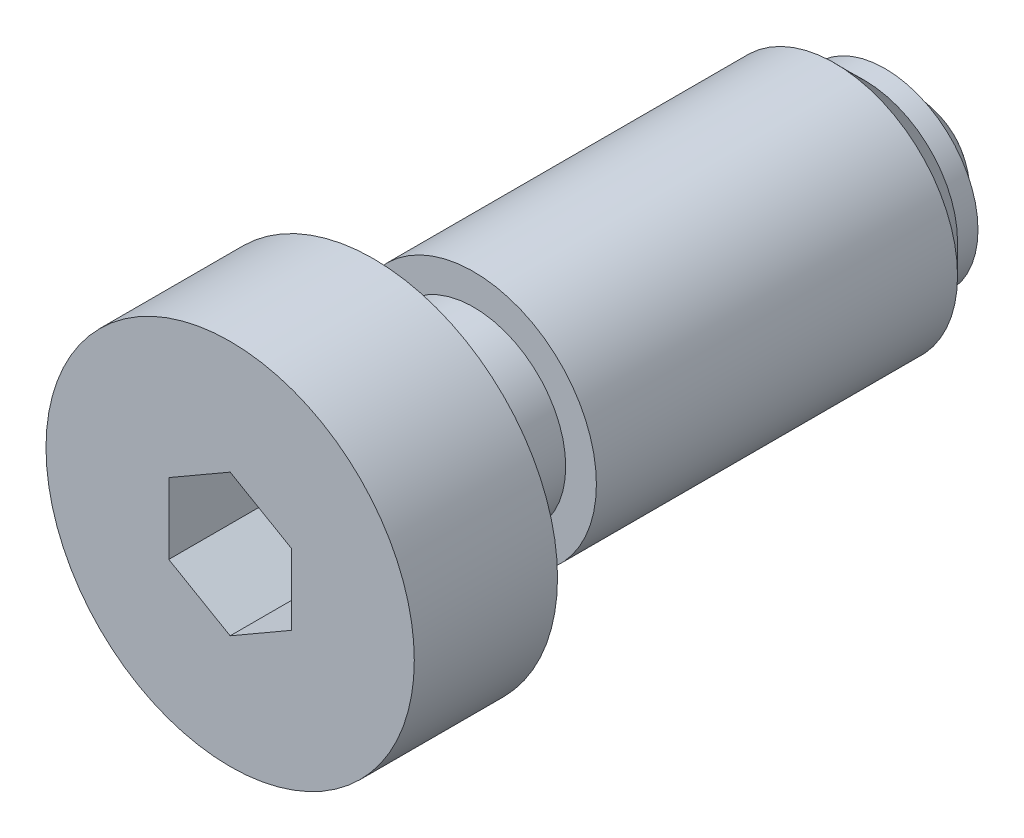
ISO-10303-21;
HEADER;
FILE_DESCRIPTION(('STEP AP214'),'2;1');
FILE_NAME('part.step','',(''),(''),'','','');
FILE_SCHEMA(('AUTOMOTIVE_DESIGN { 1 0 10303 214 1 1 1 1 }'));
ENDSEC;
DATA;
#1=APPLICATION_CONTEXT('core data for automotive mechanical design processes');
#2=APPLICATION_PROTOCOL_DEFINITION('international standard','automotive_design',2000,#1);
#3=PRODUCT_CONTEXT('',#1,'mechanical');
#4=PRODUCT('Part','Part','',(#3));
#5=PRODUCT_RELATED_PRODUCT_CATEGORY('part','',(#4));
#6=PRODUCT_DEFINITION_FORMATION('','',#4);
#7=PRODUCT_DEFINITION_CONTEXT('part definition',#1,'design');
#8=PRODUCT_DEFINITION('design','',#6,#7);
#9=PRODUCT_DEFINITION_SHAPE('','',#8);
#10=(LENGTH_UNIT() NAMED_UNIT(*) SI_UNIT(.MILLI.,.METRE.));
#11=(NAMED_UNIT(*) PLANE_ANGLE_UNIT() SI_UNIT($,.RADIAN.));
#12=(NAMED_UNIT(*) SI_UNIT($,.STERADIAN.) SOLID_ANGLE_UNIT());
#13=UNCERTAINTY_MEASURE_WITH_UNIT(LENGTH_MEASURE(1.E-05),#10,'distance_accuracy_value','');
#14=(GEOMETRIC_REPRESENTATION_CONTEXT(3) GLOBAL_UNCERTAINTY_ASSIGNED_CONTEXT((#13)) GLOBAL_UNIT_ASSIGNED_CONTEXT((#10,
#11,#12)) REPRESENTATION_CONTEXT('',''));
#15=CARTESIAN_POINT('',(0.,0.,0.));
#16=DIRECTION('',(0.,0.,1.));
#17=DIRECTION('',(1.,0.,0.));
#18=AXIS2_PLACEMENT_3D('',#15,#16,#17);
#19=CARTESIAN_POINT('',(0.,0.,29.5318271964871));
#20=DIRECTION('',(0.,0.,1.));
#21=DIRECTION('',(1.,0.,0.));
#22=AXIS2_PLACEMENT_3D('',#19,#20,#21);
#23=CYLINDRICAL_SURFACE('',#22,9.);
#24=CARTESIAN_POINT('',(0.,0.,27.5));
#25=DIRECTION('',(0.,0.,1.));
#26=DIRECTION('',(1.,0.,0.));
#27=AXIS2_PLACEMENT_3D('',#24,#25,#26);
#28=CIRCLE('',#27,9.);
#29=CARTESIAN_POINT('',(9.,0.,27.5));
#30=VERTEX_POINT('',#29);
#31=EDGE_CURVE('E9',#30,#30,#28,.T.);
#32=ORIENTED_EDGE('',*,*,#31,.T.);
#33=EDGE_LOOP('',(#32));
#34=FACE_BOUND('',#33,.T.);
#35=CARTESIAN_POINT('',(0.,0.,34.5));
#36=DIRECTION('',(0.,0.,1.));
#37=DIRECTION('',(1.,0.,0.));
#38=AXIS2_PLACEMENT_3D('',#35,#36,#37);
#39=CIRCLE('',#38,9.);
#40=CARTESIAN_POINT('',(9.,0.,34.5));
#41=VERTEX_POINT('',#40);
#42=EDGE_CURVE('E116',#41,#41,#39,.T.);
#43=ORIENTED_EDGE('',*,*,#42,.F.);
#44=EDGE_LOOP('',(#43));
#45=FACE_BOUND('',#44,.T.);
#46=ADVANCED_FACE('F14',(#34,#45),#23,.T.);
#47=CARTESIAN_POINT('',(4.5,0.,27.5));
#48=DIRECTION('',(0.,0.,-1.));
#49=DIRECTION('',(-1.,0.,0.));
#50=AXIS2_PLACEMENT_3D('',#47,#48,#49);
#51=PLANE('',#50);
#52=CARTESIAN_POINT('',(0.,0.,27.5));
#53=DIRECTION('',(0.,0.,1.));
#54=DIRECTION('',(1.,0.,0.));
#55=AXIS2_PLACEMENT_3D('',#52,#53,#54);
#56=CIRCLE('',#55,4.5);
#57=CARTESIAN_POINT('',(4.5,0.,27.5));
#58=VERTEX_POINT('',#57);
#59=EDGE_CURVE('E21',#58,#58,#56,.T.);
#60=ORIENTED_EDGE('',*,*,#59,.T.);
#61=EDGE_LOOP('',(#60));
#62=FACE_BOUND('',#61,.T.);
#63=ORIENTED_EDGE('',*,*,#31,.F.);
#64=EDGE_LOOP('',(#63));
#65=FACE_BOUND('',#64,.T.);
#66=ADVANCED_FACE('F145',(#62,#65),#51,.T.);
#67=CARTESIAN_POINT('',(0.,0.,29.5318271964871));
#68=DIRECTION('',(0.,0.,1.));
#69=DIRECTION('',(1.,0.,0.));
#70=AXIS2_PLACEMENT_3D('',#67,#68,#69);
#71=CYLINDRICAL_SURFACE('',#70,4.5);
#72=CARTESIAN_POINT('',(0.,0.,22.6));
#73=DIRECTION('',(0.,0.,1.));
#74=DIRECTION('',(1.,0.,0.));
#75=AXIS2_PLACEMENT_3D('',#72,#73,#74);
#76=CIRCLE('',#75,4.5);
#77=CARTESIAN_POINT('',(4.5,0.,22.6));
#78=VERTEX_POINT('',#77);
#79=EDGE_CURVE('E140',#78,#78,#76,.T.);
#80=ORIENTED_EDGE('',*,*,#79,.T.);
#81=EDGE_LOOP('',(#80));
#82=FACE_BOUND('',#81,.T.);
#83=ORIENTED_EDGE('',*,*,#59,.F.);
#84=EDGE_LOOP('',(#83));
#85=FACE_BOUND('',#84,.T.);
#86=ADVANCED_FACE('F148',(#82,#85),#71,.T.);
#87=CARTESIAN_POINT('',(4.5,0.,22.6));
#88=DIRECTION('',(0.,0.,1.));
#89=DIRECTION('',(1.,0.,0.));
#90=AXIS2_PLACEMENT_3D('',#87,#88,#89);
#91=PLANE('',#90);
#92=CARTESIAN_POINT('',(0.,0.,22.6));
#93=DIRECTION('',(0.,0.,1.));
#94=DIRECTION('',(1.,0.,0.));
#95=AXIS2_PLACEMENT_3D('',#92,#93,#94);
#96=CIRCLE('',#95,6.);
#97=CARTESIAN_POINT('',(6.,0.,22.6));
#98=VERTEX_POINT('',#97);
#99=EDGE_CURVE('E137',#98,#98,#96,.T.);
#100=ORIENTED_EDGE('',*,*,#99,.T.);
#101=EDGE_LOOP('',(#100));
#102=FACE_BOUND('',#101,.T.);
#103=ORIENTED_EDGE('',*,*,#79,.F.);
#104=EDGE_LOOP('',(#103));
#105=FACE_BOUND('',#104,.T.);
#106=ADVANCED_FACE('F150',(#102,#105),#91,.T.);
#107=CARTESIAN_POINT('',(0.,0.,29.5318271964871));
#108=DIRECTION('',(0.,0.,1.));
#109=DIRECTION('',(1.,0.,0.));
#110=AXIS2_PLACEMENT_3D('',#107,#108,#109);
#111=CYLINDRICAL_SURFACE('',#110,6.);
#112=CARTESIAN_POINT('',(0.,0.,4.95));
#113=DIRECTION('',(0.,0.,1.));
#114=DIRECTION('',(1.,0.,0.));
#115=AXIS2_PLACEMENT_3D('',#112,#113,#114);
#116=CIRCLE('',#115,6.);
#117=CARTESIAN_POINT('',(6.,0.,4.95));
#118=VERTEX_POINT('',#117);
#119=EDGE_CURVE('E134',#118,#118,#116,.T.);
#120=ORIENTED_EDGE('',*,*,#119,.T.);
#121=EDGE_LOOP('',(#120));
#122=FACE_BOUND('',#121,.T.);
#123=ORIENTED_EDGE('',*,*,#99,.F.);
#124=EDGE_LOOP('',(#123));
#125=FACE_BOUND('',#124,.T.);
#126=ADVANCED_FACE('F158',(#122,#125),#111,.T.);
#127=CARTESIAN_POINT('',(0.,0.,4.95));
#128=DIRECTION('',(0.,0.,1.));
#129=DIRECTION('',(1.,0.,0.));
#130=AXIS2_PLACEMENT_3D('',#127,#128,#129);
#131=CONICAL_SURFACE('',#130,6.,0.785398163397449);
#132=CARTESIAN_POINT('',(0.,0.,3.5));
#133=DIRECTION('',(0.,0.,1.));
#134=DIRECTION('',(1.,0.,0.));
#135=AXIS2_PLACEMENT_3D('',#132,#133,#134);
#136=CIRCLE('',#135,4.55);
#137=CARTESIAN_POINT('',(4.55,0.,3.5));
#138=VERTEX_POINT('',#137);
#139=EDGE_CURVE('E131',#138,#138,#136,.T.);
#140=ORIENTED_EDGE('',*,*,#139,.T.);
#141=EDGE_LOOP('',(#140));
#142=FACE_BOUND('',#141,.T.);
#143=ORIENTED_EDGE('',*,*,#119,.F.);
#144=EDGE_LOOP('',(#143));
#145=FACE_BOUND('',#144,.T.);
#146=ADVANCED_FACE('F189',(#142,#145),#131,.T.);
#147=CARTESIAN_POINT('',(0.,0.,29.5318271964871));
#148=DIRECTION('',(0.,0.,1.));
#149=DIRECTION('',(1.,0.,0.));
#150=AXIS2_PLACEMENT_3D('',#147,#148,#149);
#151=CYLINDRICAL_SURFACE('',#150,4.55);
#152=CARTESIAN_POINT('',(0.,0.,2.5));
#153=DIRECTION('',(0.,0.,1.));
#154=DIRECTION('',(1.,0.,0.));
#155=AXIS2_PLACEMENT_3D('',#152,#153,#154);
#156=CIRCLE('',#155,4.55);
#157=CARTESIAN_POINT('',(4.55,0.,2.5));
#158=VERTEX_POINT('',#157);
#159=EDGE_CURVE('E128',#158,#158,#156,.T.);
#160=ORIENTED_EDGE('',*,*,#159,.T.);
#161=EDGE_LOOP('',(#160));
#162=FACE_BOUND('',#161,.T.);
#163=ORIENTED_EDGE('',*,*,#139,.F.);
#164=EDGE_LOOP('',(#163));
#165=FACE_BOUND('',#164,.T.);
#166=ADVANCED_FACE('F185',(#162,#165),#151,.T.);
#167=CARTESIAN_POINT('',(4.55,0.,2.5));
#168=DIRECTION('',(0.,0.,-1.));
#169=DIRECTION('',(-1.,0.,0.));
#170=AXIS2_PLACEMENT_3D('',#167,#168,#169);
#171=PLANE('',#170);
#172=CARTESIAN_POINT('',(0.,0.,2.5));
#173=DIRECTION('',(0.,0.,1.));
#174=DIRECTION('',(1.,0.,0.));
#175=AXIS2_PLACEMENT_3D('',#172,#173,#174);
#176=CIRCLE('',#175,3.70809924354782);
#177=CARTESIAN_POINT('',(3.70809924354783,0.,2.5));
#178=VERTEX_POINT('',#177);
#179=EDGE_CURVE('E125',#178,#178,#176,.T.);
#180=ORIENTED_EDGE('',*,*,#179,.T.);
#181=EDGE_LOOP('',(#180));
#182=FACE_BOUND('',#181,.T.);
#183=ORIENTED_EDGE('',*,*,#159,.F.);
#184=EDGE_LOOP('',(#183));
#185=FACE_BOUND('',#184,.T.);
#186=ADVANCED_FACE('F178',(#182,#185),#171,.T.);
#187=CARTESIAN_POINT('',(0.,0.,4.));
#188=DIRECTION('',(0.,0.,1.));
#189=DIRECTION('',(1.,0.,0.));
#190=AXIS2_PLACEMENT_3D('',#187,#188,#189);
#191=SPHERICAL_SURFACE('',#190,4.);
#192=ORIENTED_EDGE('',*,*,#179,.F.);
#193=EDGE_LOOP('',(#192));
#194=FACE_BOUND('',#193,.T.);
#195=ADVANCED_FACE('F170',(#194),#191,.T.);
#196=CARTESIAN_POINT('',(9.,0.,34.5));
#197=DIRECTION('',(0.,0.,1.));
#198=DIRECTION('',(1.,0.,0.));
#199=AXIS2_PLACEMENT_3D('',#196,#197,#198);
#200=PLANE('',#199);
#201=DIRECTION('',(-0.866025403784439,0.5,0.));
#202=VECTOR('',#201,1.);
#203=CARTESIAN_POINT('',(3.,1.73205080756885,34.5));
#204=LINE('',#203,#202);
#205=CARTESIAN_POINT('',(3.,1.73205080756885,34.5));
#206=VERTEX_POINT('',#205);
#207=CARTESIAN_POINT('',(0.,3.46410161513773,34.5));
#208=VERTEX_POINT('',#207);
#209=EDGE_CURVE('E28',#206,#208,#204,.T.);
#210=ORIENTED_EDGE('',*,*,#209,.F.);
#211=DIRECTION('',(0.,1.,0.));
#212=VECTOR('',#211,1.);
#213=CARTESIAN_POINT('',(3.,-1.7320508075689,34.5));
#214=LINE('',#213,#212);
#215=CARTESIAN_POINT('',(3.,-1.7320508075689,34.5));
#216=VERTEX_POINT('',#215);
#217=EDGE_CURVE('E98',#216,#206,#214,.T.);
#218=ORIENTED_EDGE('',*,*,#217,.F.);
#219=DIRECTION('',(0.866025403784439,0.5,0.));
#220=VECTOR('',#219,1.);
#221=CARTESIAN_POINT('',(0.,-3.46410161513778,34.5));
#222=LINE('',#221,#220);
#223=CARTESIAN_POINT('',(0.,-3.46410161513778,34.5));
#224=VERTEX_POINT('',#223);
#225=EDGE_CURVE('E92',#224,#216,#222,.T.);
#226=ORIENTED_EDGE('',*,*,#225,.F.);
#227=DIRECTION('',(0.866025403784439,-0.5,0.));
#228=VECTOR('',#227,1.);
#229=CARTESIAN_POINT('',(-3.,-1.7320508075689,34.5));
#230=LINE('',#229,#228);
#231=CARTESIAN_POINT('',(-3.,-1.7320508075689,34.5));
#232=VERTEX_POINT('',#231);
#233=EDGE_CURVE('E90',#232,#224,#230,.T.);
#234=ORIENTED_EDGE('',*,*,#233,.F.);
#235=DIRECTION('',(0.,-1.,0.));
#236=VECTOR('',#235,1.);
#237=CARTESIAN_POINT('',(-3.,1.73205080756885,34.5));
#238=LINE('',#237,#236);
#239=CARTESIAN_POINT('',(-3.,1.73205080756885,34.5));
#240=VERTEX_POINT('',#239);
#241=EDGE_CURVE('E71',#240,#232,#238,.T.);
#242=ORIENTED_EDGE('',*,*,#241,.F.);
#243=DIRECTION('',(-0.866025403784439,-0.5,0.));
#244=VECTOR('',#243,1.);
#245=CARTESIAN_POINT('',(0.,3.46410161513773,34.5));
#246=LINE('',#245,#244);
#247=EDGE_CURVE('E82',#208,#240,#246,.T.);
#248=ORIENTED_EDGE('',*,*,#247,.F.);
#249=EDGE_LOOP('',(#210,#218,#226,#234,#242,#248));
#250=FACE_BOUND('',#249,.T.);
#251=ORIENTED_EDGE('',*,*,#42,.T.);
#252=EDGE_LOOP('',(#251));
#253=FACE_BOUND('',#252,.T.);
#254=ADVANCED_FACE('F86',(#250,#253),#200,.T.);
#255=CARTESIAN_POINT('',(3.,1.73205080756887,29.5));
#256=DIRECTION('',(0.5,0.866025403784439,0.));
#257=DIRECTION('',(0.866025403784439,-0.5,0.));
#258=AXIS2_PLACEMENT_3D('',#255,#256,#257);
#259=PLANE('',#258);
#260=ORIENTED_EDGE('',*,*,#209,.T.);
#261=DIRECTION('',(0.,0.,1.));
#262=VECTOR('',#261,1.);
#263=CARTESIAN_POINT('',(0.,3.46410161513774,29.5));
#264=LINE('',#263,#262);
#265=CARTESIAN_POINT('',(0.,3.46410161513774,29.5));
#266=VERTEX_POINT('',#265);
#267=EDGE_CURVE('E79',#266,#208,#264,.T.);
#268=ORIENTED_EDGE('',*,*,#267,.F.);
#269=DIRECTION('',(-0.866025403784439,0.5,0.));
#270=VECTOR('',#269,1.);
#271=CARTESIAN_POINT('',(3.,1.73205080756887,29.5));
#272=LINE('',#271,#270);
#273=CARTESIAN_POINT('',(3.,1.73205080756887,29.5));
#274=VERTEX_POINT('',#273);
#275=EDGE_CURVE('E100',#274,#266,#272,.T.);
#276=ORIENTED_EDGE('',*,*,#275,.F.);
#277=DIRECTION('',(0.,0.,1.));
#278=VECTOR('',#277,1.);
#279=CARTESIAN_POINT('',(3.,1.73205080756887,29.5));
#280=LINE('',#279,#278);
#281=EDGE_CURVE('E35',#274,#206,#280,.T.);
#282=ORIENTED_EDGE('',*,*,#281,.T.);
#283=EDGE_LOOP('',(#260,#268,#276,#282));
#284=FACE_BOUND('',#283,.T.);
#285=ADVANCED_FACE('F169',(#284),#259,.F.);
#286=CARTESIAN_POINT('',(3.,-1.73205080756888,29.5));
#287=DIRECTION('',(1.,0.,0.));
#288=DIRECTION('',(0.,-1.,0.));
#289=AXIS2_PLACEMENT_3D('',#286,#287,#288);
#290=PLANE('',#289);
#291=ORIENTED_EDGE('',*,*,#217,.T.);
#292=ORIENTED_EDGE('',*,*,#281,.F.);
#293=DIRECTION('',(0.,1.,0.));
#294=VECTOR('',#293,1.);
#295=CARTESIAN_POINT('',(3.,-1.73205080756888,29.5));
#296=LINE('',#295,#294);
#297=CARTESIAN_POINT('',(3.,-1.73205080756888,29.5));
#298=VERTEX_POINT('',#297);
#299=EDGE_CURVE('E112',#298,#274,#296,.T.);
#300=ORIENTED_EDGE('',*,*,#299,.F.);
#301=DIRECTION('',(0.,0.,1.));
#302=VECTOR('',#301,1.);
#303=CARTESIAN_POINT('',(3.,-1.73205080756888,29.5));
#304=LINE('',#303,#302);
#305=EDGE_CURVE('E117',#298,#216,#304,.T.);
#306=ORIENTED_EDGE('',*,*,#305,.T.);
#307=EDGE_LOOP('',(#291,#292,#300,#306));
#308=FACE_BOUND('',#307,.T.);
#309=ADVANCED_FACE('F176',(#308),#290,.F.);
#310=CARTESIAN_POINT('',(0.,-3.46410161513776,29.5));
#311=DIRECTION('',(0.5,-0.866025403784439,0.));
#312=DIRECTION('',(-0.866025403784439,-0.5,0.));
#313=AXIS2_PLACEMENT_3D('',#310,#311,#312);
#314=PLANE('',#313);
#315=ORIENTED_EDGE('',*,*,#225,.T.);
#316=ORIENTED_EDGE('',*,*,#305,.F.);
#317=DIRECTION('',(0.866025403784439,0.5,0.));
#318=VECTOR('',#317,1.);
#319=CARTESIAN_POINT('',(0.,-3.46410161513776,29.5));
#320=LINE('',#319,#318);
#321=CARTESIAN_POINT('',(0.,-3.46410161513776,29.5));
#322=VERTEX_POINT('',#321);
#323=EDGE_CURVE('E109',#322,#298,#320,.T.);
#324=ORIENTED_EDGE('',*,*,#323,.F.);
#325=DIRECTION('',(0.,0.,1.));
#326=VECTOR('',#325,1.);
#327=CARTESIAN_POINT('',(0.,-3.46410161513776,29.5));
#328=LINE('',#327,#326);
#329=EDGE_CURVE('E119',#322,#224,#328,.T.);
#330=ORIENTED_EDGE('',*,*,#329,.T.);
#331=EDGE_LOOP('',(#315,#316,#324,#330));
#332=FACE_BOUND('',#331,.T.);
#333=ADVANCED_FACE('F252',(#332),#314,.F.);
#334=CARTESIAN_POINT('',(-3.,-1.73205080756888,29.5));
#335=DIRECTION('',(-0.5,-0.866025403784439,0.));
#336=DIRECTION('',(-0.866025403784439,0.5,0.));
#337=AXIS2_PLACEMENT_3D('',#334,#335,#336);
#338=PLANE('',#337);
#339=ORIENTED_EDGE('',*,*,#233,.T.);
#340=ORIENTED_EDGE('',*,*,#329,.F.);
#341=DIRECTION('',(0.866025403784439,-0.5,0.));
#342=VECTOR('',#341,1.);
#343=CARTESIAN_POINT('',(-3.,-1.73205080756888,29.5));
#344=LINE('',#343,#342);
#345=CARTESIAN_POINT('',(-3.,-1.73205080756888,29.5));
#346=VERTEX_POINT('',#345);
#347=EDGE_CURVE('E106',#346,#322,#344,.T.);
#348=ORIENTED_EDGE('',*,*,#347,.F.);
#349=DIRECTION('',(0.,0.,1.));
#350=VECTOR('',#349,1.);
#351=CARTESIAN_POINT('',(-3.,-1.73205080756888,29.5));
#352=LINE('',#351,#350);
#353=EDGE_CURVE('E78',#346,#232,#352,.T.);
#354=ORIENTED_EDGE('',*,*,#353,.T.);
#355=EDGE_LOOP('',(#339,#340,#348,#354));
#356=FACE_BOUND('',#355,.T.);
#357=ADVANCED_FACE('F261',(#356),#338,.F.);
#358=CARTESIAN_POINT('',(-3.,1.73205080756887,29.5));
#359=DIRECTION('',(-1.,0.,0.));
#360=DIRECTION('',(0.,1.,0.));
#361=AXIS2_PLACEMENT_3D('',#358,#359,#360);
#362=PLANE('',#361);
#363=ORIENTED_EDGE('',*,*,#241,.T.);
#364=ORIENTED_EDGE('',*,*,#353,.F.);
#365=DIRECTION('',(0.,-1.,0.));
#366=VECTOR('',#365,1.);
#367=CARTESIAN_POINT('',(-3.,1.73205080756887,29.5));
#368=LINE('',#367,#366);
#369=CARTESIAN_POINT('',(-3.,1.73205080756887,29.5));
#370=VERTEX_POINT('',#369);
#371=EDGE_CURVE('E74',#370,#346,#368,.T.);
#372=ORIENTED_EDGE('',*,*,#371,.F.);
#373=DIRECTION('',(0.,0.,1.));
#374=VECTOR('',#373,1.);
#375=CARTESIAN_POINT('',(-3.,1.73205080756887,29.5));
#376=LINE('',#375,#374);
#377=EDGE_CURVE('E67',#370,#240,#376,.T.);
#378=ORIENTED_EDGE('',*,*,#377,.T.);
#379=EDGE_LOOP('',(#363,#364,#372,#378));
#380=FACE_BOUND('',#379,.T.);
#381=ADVANCED_FACE('F69',(#380),#362,.F.);
#382=CARTESIAN_POINT('',(0.,3.46410161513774,29.5));
#383=DIRECTION('',(-0.5,0.866025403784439,0.));
#384=DIRECTION('',(0.866025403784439,0.5,0.));
#385=AXIS2_PLACEMENT_3D('',#382,#383,#384);
#386=PLANE('',#385);
#387=ORIENTED_EDGE('',*,*,#247,.T.);
#388=ORIENTED_EDGE('',*,*,#377,.F.);
#389=DIRECTION('',(-0.866025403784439,-0.5,0.));
#390=VECTOR('',#389,1.);
#391=CARTESIAN_POINT('',(0.,3.46410161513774,29.5));
#392=LINE('',#391,#390);
#393=EDGE_CURVE('E103',#266,#370,#392,.T.);
#394=ORIENTED_EDGE('',*,*,#393,.F.);
#395=ORIENTED_EDGE('',*,*,#267,.T.);
#396=EDGE_LOOP('',(#387,#388,#394,#395));
#397=FACE_BOUND('',#396,.T.);
#398=ADVANCED_FACE('F83',(#397),#386,.F.);
#399=CARTESIAN_POINT('',(0.,3.46410161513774,29.5));
#400=DIRECTION('',(0.,0.,1.));
#401=DIRECTION('',(0.,-1.,0.));
#402=AXIS2_PLACEMENT_3D('',#399,#400,#401);
#403=PLANE('',#402);
#404=ORIENTED_EDGE('',*,*,#275,.T.);
#405=ORIENTED_EDGE('',*,*,#393,.T.);
#406=ORIENTED_EDGE('',*,*,#371,.T.);
#407=ORIENTED_EDGE('',*,*,#347,.T.);
#408=ORIENTED_EDGE('',*,*,#323,.T.);
#409=ORIENTED_EDGE('',*,*,#299,.T.);
#410=EDGE_LOOP('',(#404,#405,#406,#407,#408,#409));
#411=FACE_BOUND('',#410,.T.);
#412=ADVANCED_FACE('F288',(#411),#403,.T.);
#413=CLOSED_SHELL('',(#46,#66,#86,#106,#126,#146,#166,#186,#195,#254,#285,#309,#333,#357,#381,
#398,#412));
#414=MANIFOLD_SOLID_BREP('B1',#413);
#415=ADVANCED_BREP_SHAPE_REPRESENTATION('',(#18,#414),#14);
#416=SHAPE_DEFINITION_REPRESENTATION(#9,#415);
ENDSEC;
END-ISO-10303-21;
